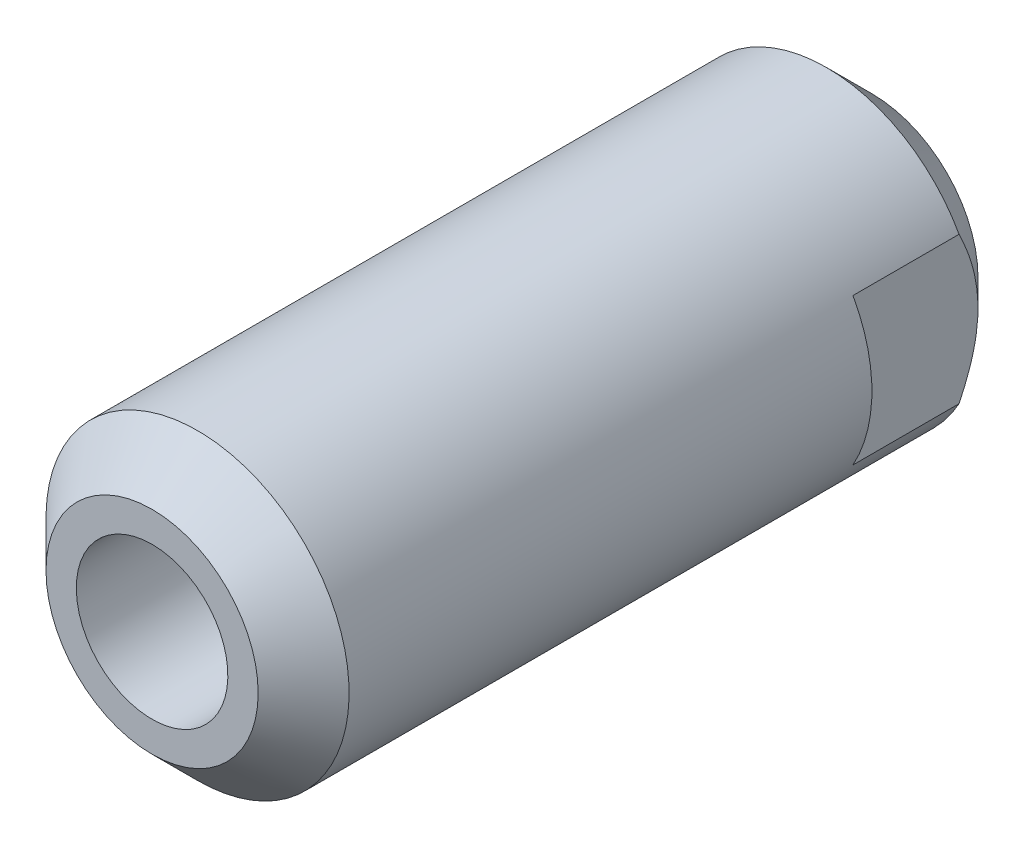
ISO-10303-21;
HEADER;
FILE_DESCRIPTION(('STEP AP214'),'2;1');
FILE_NAME('part.step','',(''),(''),'','','');
FILE_SCHEMA(('AUTOMOTIVE_DESIGN { 1 0 10303 214 1 1 1 1 }'));
ENDSEC;
DATA;
#1=APPLICATION_CONTEXT('core data for automotive mechanical design processes');
#2=APPLICATION_PROTOCOL_DEFINITION('international standard','automotive_design',2000,#1);
#3=PRODUCT_CONTEXT('',#1,'mechanical');
#4=PRODUCT('Part','Part','',(#3));
#5=PRODUCT_RELATED_PRODUCT_CATEGORY('part','',(#4));
#6=PRODUCT_DEFINITION_FORMATION('','',#4);
#7=PRODUCT_DEFINITION_CONTEXT('part definition',#1,'design');
#8=PRODUCT_DEFINITION('design','',#6,#7);
#9=PRODUCT_DEFINITION_SHAPE('','',#8);
#10=(LENGTH_UNIT() NAMED_UNIT(*) SI_UNIT(.MILLI.,.METRE.));
#11=(NAMED_UNIT(*) PLANE_ANGLE_UNIT() SI_UNIT($,.RADIAN.));
#12=(NAMED_UNIT(*) SI_UNIT($,.STERADIAN.) SOLID_ANGLE_UNIT());
#13=UNCERTAINTY_MEASURE_WITH_UNIT(LENGTH_MEASURE(1.E-05),#10,'distance_accuracy_value','');
#14=(GEOMETRIC_REPRESENTATION_CONTEXT(3) GLOBAL_UNCERTAINTY_ASSIGNED_CONTEXT((#13)) GLOBAL_UNIT_ASSIGNED_CONTEXT((#10,
#11,#12)) REPRESENTATION_CONTEXT('',''));
#15=CARTESIAN_POINT('',(0.,0.,0.));
#16=DIRECTION('',(0.,0.,1.));
#17=DIRECTION('',(1.,0.,0.));
#18=AXIS2_PLACEMENT_3D('',#15,#16,#17);
#19=CARTESIAN_POINT('',(-3.5000000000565,-1.9597295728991,4.));
#20=DIRECTION('',(0.,0.,1.));
#21=DIRECTION('',(2.88279763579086E-11,1.,0.));
#22=AXIS2_PLACEMENT_3D('',#19,#20,#21);
#23=PLANE('',#22);
#24=DIRECTION('',(-2.88279763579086E-11,-1.,0.));
#25=VECTOR('',#24,1.);
#26=CARTESIAN_POINT('',(-3.5,1.0089791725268E-10,4.));
#27=LINE('',#26,#25);
#28=CARTESIAN_POINT('',(-3.50000000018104,1.9364916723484,4.0000000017));
#29=VERTEX_POINT('',#28);
#30=CARTESIAN_POINT('',(-3.50000000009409,-1.93649167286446,4.0000000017));
#31=VERTEX_POINT('',#30);
#32=EDGE_CURVE('E54',#29,#31,#27,.T.);
#33=ORIENTED_EDGE('',*,*,#32,.T.);
#34=CARTESIAN_POINT('',(0.,0.,4.0000000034));
#35=DIRECTION('',(0.,0.,1.));
#36=DIRECTION('',(2.88279763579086E-11,1.,0.));
#37=AXIS2_PLACEMENT_3D('',#34,#35,#36);
#38=CIRCLE('',#37,4.);
#39=EDGE_CURVE('E18',#29,#31,#38,.T.);
#40=ORIENTED_EDGE('',*,*,#39,.F.);
#41=EDGE_LOOP('',(#33,#40));
#42=FACE_BOUND('',#41,.T.);
#43=ADVANCED_FACE('F14',(#42),#23,.F.);
#44=CARTESIAN_POINT('',(4.03673525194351,-1.95972957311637,4.));
#45=DIRECTION('',(0.,0.,1.));
#46=DIRECTION('',(2.88279763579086E-11,1.,0.));
#47=AXIS2_PLACEMENT_3D('',#44,#45,#46);
#48=PLANE('',#47);
#49=DIRECTION('',(2.88279763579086E-11,1.,0.));
#50=VECTOR('',#49,1.);
#51=CARTESIAN_POINT('',(3.5,-1.0089791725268E-10,4.));
#52=LINE('',#51,#50);
#53=CARTESIAN_POINT('',(3.4999999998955,-1.93649167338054,4.0000000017));
#54=VERTEX_POINT('',#53);
#55=CARTESIAN_POINT('',(3.4999999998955,1.93649167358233,4.0000000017));
#56=VERTEX_POINT('',#55);
#57=EDGE_CURVE('E71',#54,#56,#52,.T.);
#58=ORIENTED_EDGE('',*,*,#57,.T.);
#59=CARTESIAN_POINT('',(0.,0.,4.0000000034));
#60=DIRECTION('',(0.,0.,1.));
#61=DIRECTION('',(2.88279763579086E-11,1.,0.));
#62=AXIS2_PLACEMENT_3D('',#59,#60,#61);
#63=CIRCLE('',#62,4.);
#64=EDGE_CURVE('E147',#54,#56,#63,.T.);
#65=ORIENTED_EDGE('',*,*,#64,.F.);
#66=EDGE_LOOP('',(#58,#65));
#67=FACE_BOUND('',#66,.T.);
#68=ADVANCED_FACE('F138',(#67),#48,.F.);
#69=CARTESIAN_POINT('',(-3.49999999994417,1.9364916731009,0.679127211));
#70=DIRECTION('',(1.,-2.88279763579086E-11,0.));
#71=DIRECTION('',(0.,0.,1.));
#72=AXIS2_PLACEMENT_3D('',#69,#70,#71);
#73=PLANE('',#72);
#74=CARTESIAN_POINT('',(-3.50000000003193,-1.9364916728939,1.19999999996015));
#75=CARTESIAN_POINT('',(-3.50000000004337,-1.80247512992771,1.13516589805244));
#76=CARTESIAN_POINT('',(-3.50000000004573,-1.66626825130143,1.0743335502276));
#77=CARTESIAN_POINT('',(-3.50000000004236,-1.38880917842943,0.963303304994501));
#78=CARTESIAN_POINT('',(-3.50000000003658,-1.24753460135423,0.913161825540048));
#79=CARTESIAN_POINT('',(-3.50000000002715,-0.962724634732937,0.827494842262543));
#80=CARTESIAN_POINT('',(-3.50000000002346,-0.819251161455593,0.791769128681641));
#81=CARTESIAN_POINT('',(-3.50000000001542,-0.529385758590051,0.736962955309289));
#82=CARTESIAN_POINT('',(-3.50000000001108,-0.383001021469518,0.717845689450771));
#83=CARTESIAN_POINT('',(-3.50000000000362,-0.126607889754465,0.700581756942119));
#84=CARTESIAN_POINT('',(-3.50000000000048,-0.0168665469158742,0.698323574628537));
#85=CARTESIAN_POINT('',(-3.49999999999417,0.2023830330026,0.70413430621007));
#86=CARTESIAN_POINT('',(-3.49999999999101,0.311891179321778,0.712206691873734));
#87=CARTESIAN_POINT('',(-3.49999999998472,0.529814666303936,0.738216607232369));
#88=CARTESIAN_POINT('',(-3.4999999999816,0.63822887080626,0.756163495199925));
#89=CARTESIAN_POINT('',(-3.49999999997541,0.853159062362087,0.800947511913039));
#90=CARTESIAN_POINT('',(-3.49999999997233,0.959675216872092,0.827783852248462));
#91=CARTESIAN_POINT('',(-3.49999999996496,1.21527506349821,0.902193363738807));
#92=CARTESIAN_POINT('',(-3.4999999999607,1.36320564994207,0.95373216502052));
#93=CARTESIAN_POINT('',(-3.49999999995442,1.58115754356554,1.04000233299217));
#94=CARTESIAN_POINT('',(-3.49999999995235,1.65304571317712,1.07020061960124));
#95=CARTESIAN_POINT('',(-3.49999999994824,1.79563441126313,1.13322135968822));
#96=CARTESIAN_POINT('',(-3.4999999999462,1.86633535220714,1.16604287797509));
#97=CARTESIAN_POINT('',(-3.49999999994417,1.93649167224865,1.1999999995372));
#98=B_SPLINE_CURVE_WITH_KNOTS('',3,(#74,#75,#76,#77,#78,#79,#80,#81,#82,#83,#84,#85,#86,#87,#88,
#89,#90,#91,#92,#93,#94,#95,#96,#97),.UNSPECIFIED.,.F.,.F.,(4,2,2,2,2,2,2,2,2,2,2,4),(0.,
0.446907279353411,0.89611760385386,1.33885462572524,1.78060797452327,2.10943388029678,
2.43837032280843,2.76761904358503,3.09683857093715,3.5660095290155,3.79989281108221,
4.03369308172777),.UNSPECIFIED.);
#99=CARTESIAN_POINT('',(-3.50000000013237,-1.93649167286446,1.2));
#100=VERTEX_POINT('',#99);
#101=CARTESIAN_POINT('',(-3.5000000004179,1.9364916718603,1.1999999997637));
#102=VERTEX_POINT('',#101);
#103=EDGE_CURVE('E70',#100,#102,#98,.T.);
#104=ORIENTED_EDGE('',*,*,#103,.F.);
#105=DIRECTION('',(0.,0.,-1.));
#106=VECTOR('',#105,1.);
#107=CARTESIAN_POINT('',(-3.50000000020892,-1.93649167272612,9.5));
#108=LINE('',#107,#106);
#109=EDGE_CURVE('E63',#31,#100,#108,.T.);
#110=ORIENTED_EDGE('',*,*,#109,.F.);
#111=ORIENTED_EDGE('',*,*,#32,.F.);
#112=DIRECTION('',(0.,0.,1.));
#113=VECTOR('',#112,1.);
#114=CARTESIAN_POINT('',(-3.50000000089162,1.93649167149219,9.5));
#115=LINE('',#114,#113);
#116=EDGE_CURVE('E65',#102,#29,#115,.T.);
#117=ORIENTED_EDGE('',*,*,#116,.F.);
#118=EDGE_LOOP('',(#104,#110,#111,#117));
#119=FACE_BOUND('',#118,.T.);
#120=ADVANCED_FACE('F68',(#119),#73,.F.);
#121=CARTESIAN_POINT('',(3.50000000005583,1.9364916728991,4.));
#122=DIRECTION('',(-1.,2.88279763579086E-11,0.));
#123=DIRECTION('',(0.,0.,-1.));
#124=AXIS2_PLACEMENT_3D('',#121,#122,#123);
#125=PLANE('',#124);
#126=CARTESIAN_POINT('',(3.50000000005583,1.93649167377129,1.20000000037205));
#127=CARTESIAN_POINT('',(3.50000000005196,1.80247513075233,1.13516589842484));
#128=CARTESIAN_POINT('',(3.50000000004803,1.66626825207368,1.0743335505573));
#129=CARTESIAN_POINT('',(3.50000000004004,1.38880917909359,0.963303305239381));
#130=CARTESIAN_POINT('',(3.50000000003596,1.24753460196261,0.913161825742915));
#131=CARTESIAN_POINT('',(3.50000000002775,0.962724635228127,0.827494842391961));
#132=CARTESIAN_POINT('',(3.50000000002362,0.819251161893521,0.791769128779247));
#133=CARTESIAN_POINT('',(3.50000000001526,0.529385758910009,0.736962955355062));
#134=CARTESIAN_POINT('',(3.50000000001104,0.383001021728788,0.717845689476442));
#135=CARTESIAN_POINT('',(3.50000000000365,0.126607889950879,0.700581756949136));
#136=CARTESIAN_POINT('',(3.50000000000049,0.0168665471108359,0.6983235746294));
#137=CARTESIAN_POINT('',(3.49999999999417,-0.202383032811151,0.704134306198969));
#138=CARTESIAN_POINT('',(3.49999999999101,-0.311891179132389,0.712206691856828));
#139=CARTESIAN_POINT('',(3.49999999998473,-0.529814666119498,0.738216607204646));
#140=CARTESIAN_POINT('',(3.4999999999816,-0.638228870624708,0.756163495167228));
#141=CARTESIAN_POINT('',(3.4999999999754,-0.853159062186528,0.800947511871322));
#142=CARTESIAN_POINT('',(3.49999999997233,-0.959675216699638,0.827783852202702));
#143=CARTESIAN_POINT('',(3.49999999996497,-1.2152750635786,0.902193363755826));
#144=CARTESIAN_POINT('',(3.4999999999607,-1.36320565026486,0.953732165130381));
#145=CARTESIAN_POINT('',(3.49999999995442,-1.5811575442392,1.04000233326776));
#146=CARTESIAN_POINT('',(3.49999999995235,-1.65304571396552,1.0702006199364));
#147=CARTESIAN_POINT('',(3.49999999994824,-1.79563441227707,1.1332213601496));
#148=CARTESIAN_POINT('',(3.4999999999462,-1.8663353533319,1.16604287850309));
#149=CARTESIAN_POINT('',(3.49999999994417,-1.93649167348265,1.2000000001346));
#150=B_SPLINE_CURVE_WITH_KNOTS('',3,(#126,#127,#128,#129,#130,#131,#132,#133,#134,#135,#136,
#137,#138,#139,#140,#141,#142,#143,#144,#145,#146,#147,#148,#149),.UNSPECIFIED.,.F.,.F.,(4,2,2,
2,2,2,2,2,2,2,2,4),(0.,0.446907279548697,0.896117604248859,1.33885462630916,1.78060797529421,
2.10943388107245,2.43837032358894,2.76761904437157,3.09683857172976,3.56600953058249,
3.79989281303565,4.03369308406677),.UNSPECIFIED.);
#151=CARTESIAN_POINT('',(3.49999999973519,1.93649167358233,1.2));
#152=VERTEX_POINT('',#151);
#153=CARTESIAN_POINT('',(3.49999999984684,-1.93649167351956,1.2000000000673));
#154=VERTEX_POINT('',#153);
#155=EDGE_CURVE('E33',#152,#154,#150,.T.);
#156=ORIENTED_EDGE('',*,*,#155,.F.);
#157=DIRECTION('',(0.,0.,-1.));
#158=VECTOR('',#157,1.);
#159=CARTESIAN_POINT('',(3.49999999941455,1.93649167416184,9.5));
#160=LINE('',#159,#158);
#161=EDGE_CURVE('E81',#56,#152,#160,.T.);
#162=ORIENTED_EDGE('',*,*,#161,.F.);
#163=ORIENTED_EDGE('',*,*,#57,.F.);
#164=DIRECTION('',(0.,0.,1.));
#165=VECTOR('',#164,1.);
#166=CARTESIAN_POINT('',(3.4999999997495,-1.93649167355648,9.5));
#167=LINE('',#166,#165);
#168=EDGE_CURVE('E74',#154,#54,#167,.T.);
#169=ORIENTED_EDGE('',*,*,#168,.F.);
#170=EDGE_LOOP('',(#156,#162,#163,#169));
#171=FACE_BOUND('',#170,.T.);
#172=ADVANCED_FACE('F109',(#171),#125,.F.);
#173=CARTESIAN_POINT('',(0.,0.,1.2));
#174=DIRECTION('',(0.,0.,1.));
#175=DIRECTION('',(2.88279763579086E-11,1.,0.));
#176=AXIS2_PLACEMENT_3D('',#173,#174,#175);
#177=CYLINDRICAL_SURFACE('',#176,4.);
#178=ORIENTED_EDGE('',*,*,#109,.T.);
#179=CARTESIAN_POINT('',(0.,0.,1.2));
#180=DIRECTION('',(0.,0.,1.));
#181=DIRECTION('',(2.88279763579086E-11,1.,0.));
#182=AXIS2_PLACEMENT_3D('',#179,#180,#181);
#183=CIRCLE('',#182,4.);
#184=EDGE_CURVE('E91',#154,#100,#183,.F.);
#185=ORIENTED_EDGE('',*,*,#184,.F.);
#186=ORIENTED_EDGE('',*,*,#168,.T.);
#187=ORIENTED_EDGE('',*,*,#64,.T.);
#188=ORIENTED_EDGE('',*,*,#161,.T.);
#189=CARTESIAN_POINT('',(0.,0.,1.2));
#190=DIRECTION('',(0.,0.,1.));
#191=DIRECTION('',(2.88279763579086E-11,1.,0.));
#192=AXIS2_PLACEMENT_3D('',#189,#190,#191);
#193=CIRCLE('',#192,4.);
#194=EDGE_CURVE('E99',#102,#152,#193,.F.);
#195=ORIENTED_EDGE('',*,*,#194,.F.);
#196=ORIENTED_EDGE('',*,*,#116,.T.);
#197=ORIENTED_EDGE('',*,*,#39,.T.);
#198=EDGE_LOOP('',(#178,#185,#186,#187,#188,#195,#196,#197));
#199=FACE_BOUND('',#198,.T.);
#200=CARTESIAN_POINT('',(0.,0.,17.8));
#201=DIRECTION('',(0.,0.,-1.));
#202=DIRECTION('',(-2.88279763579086E-11,-1.,0.));
#203=AXIS2_PLACEMENT_3D('',#200,#201,#202);
#204=CIRCLE('',#203,4.);
#205=CARTESIAN_POINT('',(-1.15311905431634E-10,-4.,17.8000000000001));
#206=VERTEX_POINT('',#205);
#207=EDGE_CURVE('E79',#206,#206,#204,.F.);
#208=ORIENTED_EDGE('',*,*,#207,.F.);
#209=EDGE_LOOP('',(#208));
#210=FACE_BOUND('',#209,.T.);
#211=ADVANCED_FACE('F60',(#199,#210),#177,.T.);
#212=CARTESIAN_POINT('',(0.,0.,19.));
#213=DIRECTION('',(0.,0.,-1.));
#214=DIRECTION('',(-2.88279763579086E-11,-1.,0.));
#215=AXIS2_PLACEMENT_3D('',#212,#213,#214);
#216=CONICAL_SURFACE('',#215,2.8,0.785398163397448);
#217=ORIENTED_EDGE('',*,*,#207,.T.);
#218=EDGE_LOOP('',(#217));
#219=FACE_BOUND('',#218,.T.);
#220=CARTESIAN_POINT('',(0.,0.,19.));
#221=DIRECTION('',(0.,0.,-1.));
#222=DIRECTION('',(-2.88279763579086E-11,-1.,0.));
#223=AXIS2_PLACEMENT_3D('',#220,#221,#222);
#224=CIRCLE('',#223,2.8);
#225=CARTESIAN_POINT('',(-8.07183338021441E-11,-2.8,19.));
#226=VERTEX_POINT('',#225);
#227=EDGE_CURVE('E88',#226,#226,#224,.F.);
#228=ORIENTED_EDGE('',*,*,#227,.F.);
#229=EDGE_LOOP('',(#228));
#230=FACE_BOUND('',#229,.T.);
#231=ADVANCED_FACE('F126',(#219,#230),#216,.T.);
#232=CARTESIAN_POINT('',(0.,0.,0.));
#233=DIRECTION('',(0.,0.,1.));
#234=DIRECTION('',(2.88279763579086E-11,1.,0.));
#235=AXIS2_PLACEMENT_3D('',#232,#233,#234);
#236=CONICAL_SURFACE('',#235,2.8,0.785398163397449);
#237=CARTESIAN_POINT('',(0.,0.,0.));
#238=DIRECTION('',(0.,0.,1.));
#239=DIRECTION('',(2.88279763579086E-11,1.,0.));
#240=AXIS2_PLACEMENT_3D('',#237,#238,#239);
#241=CIRCLE('',#240,2.8);
#242=CARTESIAN_POINT('',(8.07183338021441E-11,2.8,0.));
#243=VERTEX_POINT('',#242);
#244=EDGE_CURVE('E85',#243,#243,#241,.F.);
#245=ORIENTED_EDGE('',*,*,#244,.F.);
#246=EDGE_LOOP('',(#245));
#247=FACE_BOUND('',#246,.T.);
#248=ORIENTED_EDGE('',*,*,#155,.T.);
#249=ORIENTED_EDGE('',*,*,#184,.T.);
#250=ORIENTED_EDGE('',*,*,#103,.T.);
#251=ORIENTED_EDGE('',*,*,#194,.T.);
#252=EDGE_LOOP('',(#248,#249,#250,#251));
#253=FACE_BOUND('',#252,.T.);
#254=ADVANCED_FACE('F105',(#247,#253),#236,.T.);
#255=CARTESIAN_POINT('',(2.84335033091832,-2.83360000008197,19.));
#256=DIRECTION('',(0.,0.,1.));
#257=DIRECTION('',(2.88279763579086E-11,1.,0.));
#258=AXIS2_PLACEMENT_3D('',#255,#256,#257);
#259=PLANE('',#258);
#260=CARTESIAN_POINT('',(0.,0.,19.));
#261=DIRECTION('',(0.,0.,1.));
#262=DIRECTION('',(2.88279763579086E-11,1.,0.));
#263=AXIS2_PLACEMENT_3D('',#260,#261,#262);
#264=CIRCLE('',#263,2.);
#265=CARTESIAN_POINT('',(5.76559527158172E-11,2.,19.));
#266=VERTEX_POINT('',#265);
#267=EDGE_CURVE('E24',#266,#266,#264,.F.);
#268=ORIENTED_EDGE('',*,*,#267,.T.);
#269=EDGE_LOOP('',(#268));
#270=FACE_BOUND('',#269,.T.);
#271=ORIENTED_EDGE('',*,*,#227,.T.);
#272=EDGE_LOOP('',(#271));
#273=FACE_BOUND('',#272,.T.);
#274=ADVANCED_FACE('F115',(#270,#273),#259,.T.);
#275=CARTESIAN_POINT('',(2.84335033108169,2.83359999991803,0.));
#276=DIRECTION('',(0.,0.,-1.));
#277=DIRECTION('',(-2.88279763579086E-11,-1.,0.));
#278=AXIS2_PLACEMENT_3D('',#275,#276,#277);
#279=PLANE('',#278);
#280=CARTESIAN_POINT('',(0.,0.,0.));
#281=DIRECTION('',(0.,0.,1.));
#282=DIRECTION('',(2.88279763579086E-11,1.,0.));
#283=AXIS2_PLACEMENT_3D('',#280,#281,#282);
#284=CIRCLE('',#283,2.);
#285=CARTESIAN_POINT('',(5.76559527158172E-11,2.,0.));
#286=VERTEX_POINT('',#285);
#287=EDGE_CURVE('E9',#286,#286,#284,.T.);
#288=ORIENTED_EDGE('',*,*,#287,.T.);
#289=EDGE_LOOP('',(#288));
#290=FACE_BOUND('',#289,.T.);
#291=ORIENTED_EDGE('',*,*,#244,.T.);
#292=EDGE_LOOP('',(#291));
#293=FACE_BOUND('',#292,.T.);
#294=ADVANCED_FACE('F16',(#290,#293),#279,.T.);
#295=CARTESIAN_POINT('',(0.,0.,0.));
#296=DIRECTION('',(0.,0.,1.));
#297=DIRECTION('',(2.88279763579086E-11,1.,0.));
#298=AXIS2_PLACEMENT_3D('',#295,#296,#297);
#299=CYLINDRICAL_SURFACE('',#298,2.);
#300=ORIENTED_EDGE('',*,*,#267,.F.);
#301=EDGE_LOOP('',(#300));
#302=FACE_BOUND('',#301,.T.);
#303=ORIENTED_EDGE('',*,*,#287,.F.);
#304=EDGE_LOOP('',(#303));
#305=FACE_BOUND('',#304,.T.);
#306=ADVANCED_FACE('F124',(#302,#305),#299,.F.);
#307=CLOSED_SHELL('',(#43,#68,#120,#172,#211,#231,#254,#274,#294,#306));
#308=MANIFOLD_SOLID_BREP('B1',#307);
#309=ADVANCED_BREP_SHAPE_REPRESENTATION('',(#18,#308),#14);
#310=SHAPE_DEFINITION_REPRESENTATION(#9,#309);
ENDSEC;
END-ISO-10303-21;
